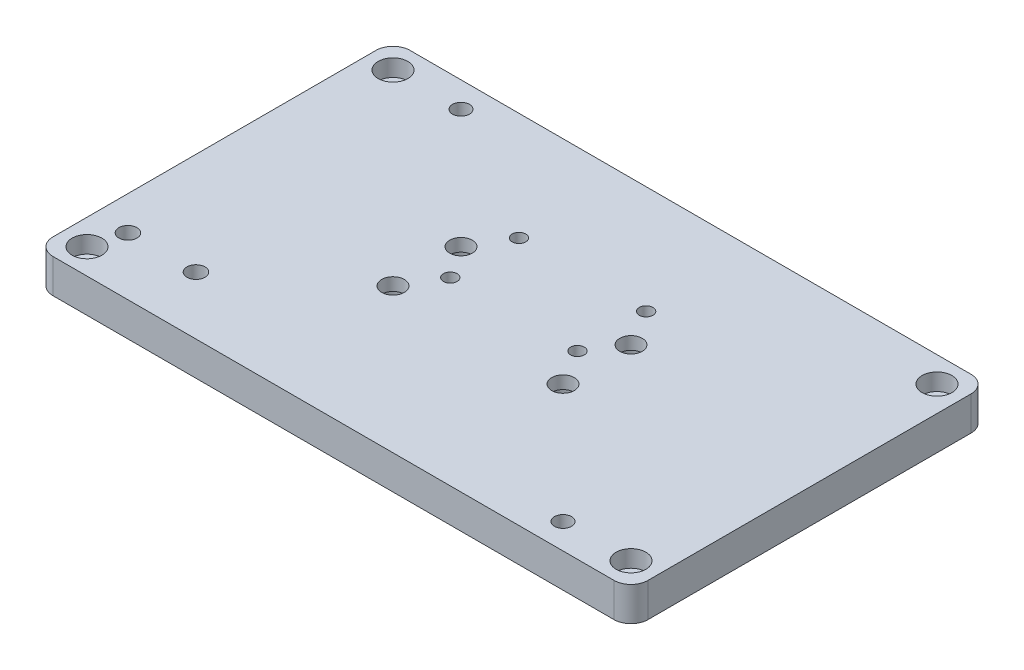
ISO-10303-21;
HEADER;
FILE_DESCRIPTION(('STEP AP214'),'2;1');
FILE_NAME('part.step','',(''),(''),'','','');
FILE_SCHEMA(('AUTOMOTIVE_DESIGN { 1 0 10303 214 1 1 1 1 }'));
ENDSEC;
DATA;
#1=APPLICATION_CONTEXT('core data for automotive mechanical design processes');
#2=APPLICATION_PROTOCOL_DEFINITION('international standard','automotive_design',2000,#1);
#3=PRODUCT_CONTEXT('',#1,'mechanical');
#4=PRODUCT('Part','Part','',(#3));
#5=PRODUCT_RELATED_PRODUCT_CATEGORY('part','',(#4));
#6=PRODUCT_DEFINITION_FORMATION('','',#4);
#7=PRODUCT_DEFINITION_CONTEXT('part definition',#1,'design');
#8=PRODUCT_DEFINITION('design','',#6,#7);
#9=PRODUCT_DEFINITION_SHAPE('','',#8);
#10=(LENGTH_UNIT() NAMED_UNIT(*) SI_UNIT(.MILLI.,.METRE.));
#11=(NAMED_UNIT(*) PLANE_ANGLE_UNIT() SI_UNIT($,.RADIAN.));
#12=(NAMED_UNIT(*) SI_UNIT($,.STERADIAN.) SOLID_ANGLE_UNIT());
#13=UNCERTAINTY_MEASURE_WITH_UNIT(LENGTH_MEASURE(1.E-05),#10,'distance_accuracy_value','');
#14=(GEOMETRIC_REPRESENTATION_CONTEXT(3) GLOBAL_UNCERTAINTY_ASSIGNED_CONTEXT((#13)) GLOBAL_UNIT_ASSIGNED_CONTEXT((#10,
#11,#12)) REPRESENTATION_CONTEXT('',''));
#15=CARTESIAN_POINT('',(0.,0.,0.));
#16=DIRECTION('',(0.,0.,1.));
#17=DIRECTION('',(1.,0.,0.));
#18=AXIS2_PLACEMENT_3D('',#15,#16,#17);
#19=CARTESIAN_POINT('',(111.125,12.7,-66.675));
#20=DIRECTION('',(-1.,0.,0.));
#21=DIRECTION('',(0.,0.,1.));
#22=AXIS2_PLACEMENT_3D('',#19,#20,#21);
#23=PLANE('',#22);
#24=DIRECTION('',(0.,0.,-1.));
#25=VECTOR('',#24,1.);
#26=CARTESIAN_POINT('',(111.125,0.,-66.675));
#27=LINE('',#26,#25);
#28=CARTESIAN_POINT('',(111.125,0.,60.325));
#29=VERTEX_POINT('',#28);
#30=CARTESIAN_POINT('',(111.125,0.,-60.325));
#31=VERTEX_POINT('',#30);
#32=EDGE_CURVE('E132',#29,#31,#27,.T.);
#33=ORIENTED_EDGE('',*,*,#32,.T.);
#34=DIRECTION('',(0.,-1.,0.));
#35=VECTOR('',#34,1.);
#36=CARTESIAN_POINT('',(111.125,12.7,-60.325));
#37=LINE('',#36,#35);
#38=CARTESIAN_POINT('',(111.125,12.7,-60.325));
#39=VERTEX_POINT('',#38);
#40=EDGE_CURVE('E109',#31,#39,#37,.F.);
#41=ORIENTED_EDGE('',*,*,#40,.T.);
#42=DIRECTION('',(0.,0.,-1.));
#43=VECTOR('',#42,1.);
#44=CARTESIAN_POINT('',(111.125,12.7,-66.675));
#45=LINE('',#44,#43);
#46=CARTESIAN_POINT('',(111.125,12.7,60.325));
#47=VERTEX_POINT('',#46);
#48=EDGE_CURVE('E142',#47,#39,#45,.T.);
#49=ORIENTED_EDGE('',*,*,#48,.F.);
#50=DIRECTION('',(0.,-1.,0.));
#51=VECTOR('',#50,1.);
#52=CARTESIAN_POINT('',(111.125,12.7,60.325));
#53=LINE('',#52,#51);
#54=EDGE_CURVE('E114',#47,#29,#53,.T.);
#55=ORIENTED_EDGE('',*,*,#54,.T.);
#56=EDGE_LOOP('',(#33,#41,#49,#55));
#57=FACE_BOUND('',#56,.T.);
#58=ADVANCED_FACE('F37',(#57),#23,.F.);
#59=CARTESIAN_POINT('',(-111.125,12.7,-66.675));
#60=DIRECTION('',(0.,0.,1.));
#61=DIRECTION('',(1.,0.,0.));
#62=AXIS2_PLACEMENT_3D('',#59,#60,#61);
#63=PLANE('',#62);
#64=DIRECTION('',(-1.,0.,0.));
#65=VECTOR('',#64,1.);
#66=CARTESIAN_POINT('',(-111.125,12.7,-66.675));
#67=LINE('',#66,#65);
#68=CARTESIAN_POINT('',(104.775,12.7,-66.675));
#69=VERTEX_POINT('',#68);
#70=CARTESIAN_POINT('',(-104.775,12.7,-66.675));
#71=VERTEX_POINT('',#70);
#72=EDGE_CURVE('E124',#69,#71,#67,.T.);
#73=ORIENTED_EDGE('',*,*,#72,.F.);
#74=DIRECTION('',(0.,-1.,0.));
#75=VECTOR('',#74,1.);
#76=CARTESIAN_POINT('',(104.775,12.7,-66.675));
#77=LINE('',#76,#75);
#78=CARTESIAN_POINT('',(104.775,0.,-66.675));
#79=VERTEX_POINT('',#78);
#80=EDGE_CURVE('E108',#69,#79,#77,.T.);
#81=ORIENTED_EDGE('',*,*,#80,.T.);
#82=DIRECTION('',(-1.,0.,0.));
#83=VECTOR('',#82,1.);
#84=CARTESIAN_POINT('',(-111.125,0.,-66.675));
#85=LINE('',#84,#83);
#86=CARTESIAN_POINT('',(-104.775,0.,-66.675));
#87=VERTEX_POINT('',#86);
#88=EDGE_CURVE('E121',#79,#87,#85,.T.);
#89=ORIENTED_EDGE('',*,*,#88,.T.);
#90=DIRECTION('',(0.,-1.,0.));
#91=VECTOR('',#90,1.);
#92=CARTESIAN_POINT('',(-104.775,12.7,-66.675));
#93=LINE('',#92,#91);
#94=EDGE_CURVE('E126',#87,#71,#93,.F.);
#95=ORIENTED_EDGE('',*,*,#94,.T.);
#96=EDGE_LOOP('',(#73,#81,#89,#95));
#97=FACE_BOUND('',#96,.T.);
#98=ADVANCED_FACE('F120',(#97),#63,.F.);
#99=CARTESIAN_POINT('',(-111.125,12.7,-66.675));
#100=DIRECTION('',(1.,0.,0.));
#101=DIRECTION('',(0.,0.,-1.));
#102=AXIS2_PLACEMENT_3D('',#99,#100,#101);
#103=PLANE('',#102);
#104=DIRECTION('',(0.,0.,1.));
#105=VECTOR('',#104,1.);
#106=CARTESIAN_POINT('',(-111.125,12.7,-66.675));
#107=LINE('',#106,#105);
#108=CARTESIAN_POINT('',(-111.125,12.7,-60.325));
#109=VERTEX_POINT('',#108);
#110=CARTESIAN_POINT('',(-111.125,12.7,60.325));
#111=VERTEX_POINT('',#110);
#112=EDGE_CURVE('E165',#109,#111,#107,.T.);
#113=ORIENTED_EDGE('',*,*,#112,.F.);
#114=DIRECTION('',(0.,-1.,0.));
#115=VECTOR('',#114,1.);
#116=CARTESIAN_POINT('',(-111.125,12.7,-60.325));
#117=LINE('',#116,#115);
#118=CARTESIAN_POINT('',(-111.125,0.,-60.325));
#119=VERTEX_POINT('',#118);
#120=EDGE_CURVE('E11',#109,#119,#117,.T.);
#121=ORIENTED_EDGE('',*,*,#120,.T.);
#122=DIRECTION('',(0.,0.,1.));
#123=VECTOR('',#122,1.);
#124=CARTESIAN_POINT('',(-111.125,0.,-66.675));
#125=LINE('',#124,#123);
#126=CARTESIAN_POINT('',(-111.125,0.,60.325));
#127=VERTEX_POINT('',#126);
#128=EDGE_CURVE('E131',#119,#127,#125,.T.);
#129=ORIENTED_EDGE('',*,*,#128,.T.);
#130=DIRECTION('',(0.,-1.,0.));
#131=VECTOR('',#130,1.);
#132=CARTESIAN_POINT('',(-111.125,12.7,60.325));
#133=LINE('',#132,#131);
#134=EDGE_CURVE('E45',#127,#111,#133,.F.);
#135=ORIENTED_EDGE('',*,*,#134,.T.);
#136=EDGE_LOOP('',(#113,#121,#129,#135));
#137=FACE_BOUND('',#136,.T.);
#138=ADVANCED_FACE('F164',(#137),#103,.F.);
#139=CARTESIAN_POINT('',(-111.125,12.7,66.675));
#140=DIRECTION('',(0.,0.,-1.));
#141=DIRECTION('',(-1.,0.,0.));
#142=AXIS2_PLACEMENT_3D('',#139,#140,#141);
#143=PLANE('',#142);
#144=DIRECTION('',(1.,0.,0.));
#145=VECTOR('',#144,1.);
#146=CARTESIAN_POINT('',(-111.125,0.,66.675));
#147=LINE('',#146,#145);
#148=CARTESIAN_POINT('',(-104.775,0.,66.675));
#149=VERTEX_POINT('',#148);
#150=CARTESIAN_POINT('',(104.775,0.,66.675));
#151=VERTEX_POINT('',#150);
#152=EDGE_CURVE('E135',#149,#151,#147,.T.);
#153=ORIENTED_EDGE('',*,*,#152,.T.);
#154=DIRECTION('',(0.,-1.,0.));
#155=VECTOR('',#154,1.);
#156=CARTESIAN_POINT('',(104.775,12.7,66.675));
#157=LINE('',#156,#155);
#158=CARTESIAN_POINT('',(104.775,12.7,66.675));
#159=VERTEX_POINT('',#158);
#160=EDGE_CURVE('E52',#151,#159,#157,.F.);
#161=ORIENTED_EDGE('',*,*,#160,.T.);
#162=DIRECTION('',(1.,0.,0.));
#163=VECTOR('',#162,1.);
#164=CARTESIAN_POINT('',(-111.125,12.7,66.675));
#165=LINE('',#164,#163);
#166=CARTESIAN_POINT('',(-104.775,12.7,66.675));
#167=VERTEX_POINT('',#166);
#168=EDGE_CURVE('E143',#167,#159,#165,.T.);
#169=ORIENTED_EDGE('',*,*,#168,.F.);
#170=DIRECTION('',(0.,-1.,0.));
#171=VECTOR('',#170,1.);
#172=CARTESIAN_POINT('',(-104.775,12.7,66.675));
#173=LINE('',#172,#171);
#174=EDGE_CURVE('E158',#167,#149,#173,.T.);
#175=ORIENTED_EDGE('',*,*,#174,.T.);
#176=EDGE_LOOP('',(#153,#161,#169,#175));
#177=FACE_BOUND('',#176,.T.);
#178=ADVANCED_FACE('F174',(#177),#143,.F.);
#179=CARTESIAN_POINT('',(0.,12.7,0.));
#180=DIRECTION('',(0.,1.,0.));
#181=DIRECTION('',(0.,0.,1.));
#182=AXIS2_PLACEMENT_3D('',#179,#180,#181);
#183=PLANE('',#182);
#184=CARTESIAN_POINT('',(-73.0250000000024,12.7,45.0249999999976));
#185=DIRECTION('',(0.,-1.,0.));
#186=DIRECTION('',(0.,0.,-1.));
#187=AXIS2_PLACEMENT_3D('',#184,#185,#186);
#188=CIRCLE('',#187,3.3782);
#189=CARTESIAN_POINT('',(-73.0250000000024,12.7,41.6467999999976));
#190=VERTEX_POINT('',#189);
#191=EDGE_CURVE('E351',#190,#190,#188,.T.);
#192=ORIENTED_EDGE('',*,*,#191,.T.);
#193=EDGE_LOOP('',(#192));
#194=FACE_BOUND('',#193,.T.);
#195=CARTESIAN_POINT('',(-98.4250000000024,12.7,45.0249999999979));
#196=DIRECTION('',(0.,-1.,0.));
#197=DIRECTION('',(0.,0.,-1.));
#198=AXIS2_PLACEMENT_3D('',#195,#196,#197);
#199=CIRCLE('',#198,3.3782);
#200=CARTESIAN_POINT('',(-98.4250000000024,12.7,41.6467999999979));
#201=VERTEX_POINT('',#200);
#202=EDGE_CURVE('E339',#201,#201,#199,.T.);
#203=ORIENTED_EDGE('',*,*,#202,.T.);
#204=EDGE_LOOP('',(#203));
#205=FACE_BOUND('',#204,.T.);
#206=CARTESIAN_POINT('',(23.7489999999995,12.7,-26.3477374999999));
#207=DIRECTION('',(0.,-1.,0.));
#208=DIRECTION('',(0.,0.,-1.));
#209=AXIS2_PLACEMENT_3D('',#206,#207,#208);
#210=CIRCLE('',#209,2.5527);
#211=CARTESIAN_POINT('',(23.7489999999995,12.7,-28.9004374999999));
#212=VERTEX_POINT('',#211);
#213=EDGE_CURVE('E327',#212,#212,#210,.T.);
#214=ORIENTED_EDGE('',*,*,#213,.T.);
#215=EDGE_LOOP('',(#214));
#216=FACE_BOUND('',#215,.T.);
#217=CARTESIAN_POINT('',(23.7489999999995,12.7,-0.693737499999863));
#218=DIRECTION('',(0.,-1.,0.));
#219=DIRECTION('',(0.,0.,-1.));
#220=AXIS2_PLACEMENT_3D('',#217,#218,#219);
#221=CIRCLE('',#220,2.5527);
#222=CARTESIAN_POINT('',(23.7489999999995,12.7,-3.24643749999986));
#223=VERTEX_POINT('',#222);
#224=EDGE_CURVE('E315',#223,#223,#221,.T.);
#225=ORIENTED_EDGE('',*,*,#224,.T.);
#226=EDGE_LOOP('',(#225));
#227=FACE_BOUND('',#226,.T.);
#228=CARTESIAN_POINT('',(-23.7490000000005,12.7,-26.3477374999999));
#229=DIRECTION('',(0.,-1.,0.));
#230=DIRECTION('',(0.,0.,-1.));
#231=AXIS2_PLACEMENT_3D('',#228,#229,#230);
#232=CIRCLE('',#231,2.5527);
#233=CARTESIAN_POINT('',(-23.7490000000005,12.7,-28.9004374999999));
#234=VERTEX_POINT('',#233);
#235=EDGE_CURVE('E303',#234,#234,#232,.T.);
#236=ORIENTED_EDGE('',*,*,#235,.T.);
#237=EDGE_LOOP('',(#236));
#238=FACE_BOUND('',#237,.T.);
#239=CARTESIAN_POINT('',(-23.7490000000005,12.7,-0.693737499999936));
#240=DIRECTION('',(0.,-1.,0.));
#241=DIRECTION('',(0.,0.,-1.));
#242=AXIS2_PLACEMENT_3D('',#239,#240,#241);
#243=CIRCLE('',#242,2.5527);
#244=CARTESIAN_POINT('',(-23.7490000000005,12.7,-3.24643749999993));
#245=VERTEX_POINT('',#244);
#246=EDGE_CURVE('E291',#245,#245,#243,.T.);
#247=ORIENTED_EDGE('',*,*,#246,.T.);
#248=EDGE_LOOP('',(#247));
#249=FACE_BOUND('',#248,.T.);
#250=CARTESIAN_POINT('',(76.2,12.7,57.15));
#251=DIRECTION('',(0.,1.,0.));
#252=DIRECTION('',(0.,0.,1.));
#253=AXIS2_PLACEMENT_3D('',#250,#251,#252);
#254=CIRCLE('',#253,3.175);
#255=CARTESIAN_POINT('',(76.2,12.7,60.325));
#256=VERTEX_POINT('',#255);
#257=EDGE_CURVE('E288',#256,#256,#254,.T.);
#258=ORIENTED_EDGE('',*,*,#257,.F.);
#259=EDGE_LOOP('',(#258));
#260=FACE_BOUND('',#259,.T.);
#261=CARTESIAN_POINT('',(-76.2,12.7,-57.1499999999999));
#262=DIRECTION('',(0.,1.,0.));
#263=DIRECTION('',(0.,0.,1.));
#264=AXIS2_PLACEMENT_3D('',#261,#262,#263);
#265=CIRCLE('',#264,3.175);
#266=CARTESIAN_POINT('',(-76.2,12.7,-53.9749999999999));
#267=VERTEX_POINT('',#266);
#268=EDGE_CURVE('E282',#267,#267,#265,.T.);
#269=ORIENTED_EDGE('',*,*,#268,.F.);
#270=EDGE_LOOP('',(#269));
#271=FACE_BOUND('',#270,.T.);
#272=CARTESIAN_POINT('',(101.6,12.7,57.15));
#273=DIRECTION('',(0.,1.,0.));
#274=DIRECTION('',(0.,0.,1.));
#275=AXIS2_PLACEMENT_3D('',#272,#273,#274);
#276=CIRCLE('',#275,5.55625);
#277=CARTESIAN_POINT('',(101.6,12.7,62.70625));
#278=VERTEX_POINT('',#277);
#279=EDGE_CURVE('E276',#278,#278,#276,.T.);
#280=ORIENTED_EDGE('',*,*,#279,.F.);
#281=EDGE_LOOP('',(#280));
#282=FACE_BOUND('',#281,.T.);
#283=CARTESIAN_POINT('',(101.6,12.7,-57.15));
#284=DIRECTION('',(0.,1.,0.));
#285=DIRECTION('',(0.,0.,1.));
#286=AXIS2_PLACEMENT_3D('',#283,#284,#285);
#287=CIRCLE('',#286,5.55625);
#288=CARTESIAN_POINT('',(101.6,12.7,-51.59375));
#289=VERTEX_POINT('',#288);
#290=EDGE_CURVE('E264',#289,#289,#287,.T.);
#291=ORIENTED_EDGE('',*,*,#290,.F.);
#292=EDGE_LOOP('',(#291));
#293=FACE_BOUND('',#292,.T.);
#294=CARTESIAN_POINT('',(-101.6,12.7,57.15));
#295=DIRECTION('',(0.,1.,0.));
#296=DIRECTION('',(0.,0.,1.));
#297=AXIS2_PLACEMENT_3D('',#294,#295,#296);
#298=CIRCLE('',#297,5.55625);
#299=CARTESIAN_POINT('',(-101.6,12.7,62.70625));
#300=VERTEX_POINT('',#299);
#301=EDGE_CURVE('E252',#300,#300,#298,.T.);
#302=ORIENTED_EDGE('',*,*,#301,.F.);
#303=EDGE_LOOP('',(#302));
#304=FACE_BOUND('',#303,.T.);
#305=CARTESIAN_POINT('',(-101.6,12.7,-57.1499999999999));
#306=DIRECTION('',(0.,1.,0.));
#307=DIRECTION('',(0.,0.,1.));
#308=AXIS2_PLACEMENT_3D('',#305,#306,#307);
#309=CIRCLE('',#308,5.55625);
#310=CARTESIAN_POINT('',(-101.6,12.7,-51.5937499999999));
#311=VERTEX_POINT('',#310);
#312=EDGE_CURVE('E240',#311,#311,#309,.T.);
#313=ORIENTED_EDGE('',*,*,#312,.F.);
#314=EDGE_LOOP('',(#313));
#315=FACE_BOUND('',#314,.T.);
#316=CARTESIAN_POINT('',(31.7500000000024,12.7,-12.6999999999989));
#317=DIRECTION('',(0.,-1.,0.));
#318=DIRECTION('',(0.,0.,-1.));
#319=AXIS2_PLACEMENT_3D('',#316,#317,#318);
#320=CIRCLE('',#319,4.21639999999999);
#321=CARTESIAN_POINT('',(31.7500000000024,12.7,-16.9163999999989));
#322=VERTEX_POINT('',#321);
#323=EDGE_CURVE('E219',#322,#322,#320,.T.);
#324=ORIENTED_EDGE('',*,*,#323,.T.);
#325=EDGE_LOOP('',(#324));
#326=FACE_BOUND('',#325,.T.);
#327=CARTESIAN_POINT('',(-31.7499999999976,12.7,-12.6999999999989));
#328=DIRECTION('',(0.,-1.,0.));
#329=DIRECTION('',(0.,0.,-1.));
#330=AXIS2_PLACEMENT_3D('',#327,#328,#329);
#331=CIRCLE('',#330,4.21639999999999);
#332=CARTESIAN_POINT('',(-31.7499999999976,12.7,-16.9163999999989));
#333=VERTEX_POINT('',#332);
#334=EDGE_CURVE('E207',#333,#333,#331,.T.);
#335=ORIENTED_EDGE('',*,*,#334,.T.);
#336=EDGE_LOOP('',(#335));
#337=FACE_BOUND('',#336,.T.);
#338=CARTESIAN_POINT('',(-31.7499999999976,12.7,12.7000000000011));
#339=DIRECTION('',(0.,-1.,0.));
#340=DIRECTION('',(0.,0.,-1.));
#341=AXIS2_PLACEMENT_3D('',#338,#339,#340);
#342=CIRCLE('',#341,4.21639999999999);
#343=CARTESIAN_POINT('',(-31.7499999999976,12.7,8.48360000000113));
#344=VERTEX_POINT('',#343);
#345=EDGE_CURVE('E195',#344,#344,#342,.T.);
#346=ORIENTED_EDGE('',*,*,#345,.T.);
#347=EDGE_LOOP('',(#346));
#348=FACE_BOUND('',#347,.T.);
#349=CARTESIAN_POINT('',(31.7500000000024,12.7,12.7000000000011));
#350=DIRECTION('',(0.,-1.,0.));
#351=DIRECTION('',(0.,0.,-1.));
#352=AXIS2_PLACEMENT_3D('',#349,#350,#351);
#353=CIRCLE('',#352,4.21639999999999);
#354=CARTESIAN_POINT('',(31.7500000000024,12.7,8.48360000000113));
#355=VERTEX_POINT('',#354);
#356=EDGE_CURVE('E137',#355,#355,#353,.T.);
#357=ORIENTED_EDGE('',*,*,#356,.T.);
#358=EDGE_LOOP('',(#357));
#359=FACE_BOUND('',#358,.T.);
#360=ORIENTED_EDGE('',*,*,#48,.T.);
#361=CARTESIAN_POINT('',(104.775,12.7,-60.325));
#362=DIRECTION('',(0.,1.,0.));
#363=DIRECTION('',(0.,0.,1.));
#364=AXIS2_PLACEMENT_3D('',#361,#362,#363);
#365=CIRCLE('',#364,6.35);
#366=EDGE_CURVE('E156',#39,#69,#365,.T.);
#367=ORIENTED_EDGE('',*,*,#366,.T.);
#368=ORIENTED_EDGE('',*,*,#72,.T.);
#369=CARTESIAN_POINT('',(-104.775,12.7,-60.325));
#370=DIRECTION('',(0.,1.,0.));
#371=DIRECTION('',(0.,0.,1.));
#372=AXIS2_PLACEMENT_3D('',#369,#370,#371);
#373=CIRCLE('',#372,6.35);
#374=EDGE_CURVE('E152',#71,#109,#373,.T.);
#375=ORIENTED_EDGE('',*,*,#374,.T.);
#376=ORIENTED_EDGE('',*,*,#112,.T.);
#377=CARTESIAN_POINT('',(-104.775,12.7,60.325));
#378=DIRECTION('',(0.,1.,0.));
#379=DIRECTION('',(0.,0.,1.));
#380=AXIS2_PLACEMENT_3D('',#377,#378,#379);
#381=CIRCLE('',#380,6.35);
#382=EDGE_CURVE('E59',#111,#167,#381,.T.);
#383=ORIENTED_EDGE('',*,*,#382,.T.);
#384=ORIENTED_EDGE('',*,*,#168,.T.);
#385=CARTESIAN_POINT('',(104.775,12.7,60.325));
#386=DIRECTION('',(0.,1.,0.));
#387=DIRECTION('',(0.,0.,1.));
#388=AXIS2_PLACEMENT_3D('',#385,#386,#387);
#389=CIRCLE('',#388,6.35);
#390=EDGE_CURVE('E154',#159,#47,#389,.T.);
#391=ORIENTED_EDGE('',*,*,#390,.T.);
#392=EDGE_LOOP('',(#360,#367,#368,#375,#376,#383,#384,#391));
#393=FACE_BOUND('',#392,.T.);
#394=ADVANCED_FACE('F169',(#194,#205,#216,#227,#238,#249,#260,#271,#282,#293,#304,#315,#326,
#337,#348,#359,#393),#183,.T.);
#395=CARTESIAN_POINT('',(0.,0.,0.));
#396=DIRECTION('',(0.,1.,0.));
#397=DIRECTION('',(0.,0.,1.));
#398=AXIS2_PLACEMENT_3D('',#395,#396,#397);
#399=PLANE('',#398);
#400=CARTESIAN_POINT('',(-73.0250000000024,0.,45.0249999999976));
#401=DIRECTION('',(0.,-1.,0.));
#402=DIRECTION('',(0.,0.,-1.));
#403=AXIS2_PLACEMENT_3D('',#400,#401,#402);
#404=CIRCLE('',#403,5.55625);
#405=CARTESIAN_POINT('',(-73.0250000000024,0.,39.4687499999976));
#406=VERTEX_POINT('',#405);
#407=EDGE_CURVE('E360',#406,#406,#404,.T.);
#408=ORIENTED_EDGE('',*,*,#407,.F.);
#409=EDGE_LOOP('',(#408));
#410=FACE_BOUND('',#409,.T.);
#411=CARTESIAN_POINT('',(-98.4250000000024,0.,45.0249999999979));
#412=DIRECTION('',(0.,-1.,0.));
#413=DIRECTION('',(0.,0.,-1.));
#414=AXIS2_PLACEMENT_3D('',#411,#412,#413);
#415=CIRCLE('',#414,5.55625);
#416=CARTESIAN_POINT('',(-98.4250000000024,0.,39.4687499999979));
#417=VERTEX_POINT('',#416);
#418=EDGE_CURVE('E348',#417,#417,#415,.T.);
#419=ORIENTED_EDGE('',*,*,#418,.F.);
#420=EDGE_LOOP('',(#419));
#421=FACE_BOUND('',#420,.T.);
#422=CARTESIAN_POINT('',(23.7489999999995,0.,-26.3477374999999));
#423=DIRECTION('',(0.,-1.,0.));
#424=DIRECTION('',(0.,0.,-1.));
#425=AXIS2_PLACEMENT_3D('',#422,#423,#424);
#426=CIRCLE('',#425,4.76249999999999);
#427=CARTESIAN_POINT('',(23.7489999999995,0.,-31.1102374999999));
#428=VERTEX_POINT('',#427);
#429=EDGE_CURVE('E336',#428,#428,#426,.T.);
#430=ORIENTED_EDGE('',*,*,#429,.F.);
#431=EDGE_LOOP('',(#430));
#432=FACE_BOUND('',#431,.T.);
#433=CARTESIAN_POINT('',(23.7489999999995,0.,-0.693737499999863));
#434=DIRECTION('',(0.,-1.,0.));
#435=DIRECTION('',(0.,0.,-1.));
#436=AXIS2_PLACEMENT_3D('',#433,#434,#435);
#437=CIRCLE('',#436,4.76249999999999);
#438=CARTESIAN_POINT('',(23.7489999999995,0.,-5.45623749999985));
#439=VERTEX_POINT('',#438);
#440=EDGE_CURVE('E324',#439,#439,#437,.T.);
#441=ORIENTED_EDGE('',*,*,#440,.F.);
#442=EDGE_LOOP('',(#441));
#443=FACE_BOUND('',#442,.T.);
#444=CARTESIAN_POINT('',(-23.7490000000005,0.,-26.3477374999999));
#445=DIRECTION('',(0.,-1.,0.));
#446=DIRECTION('',(0.,0.,-1.));
#447=AXIS2_PLACEMENT_3D('',#444,#445,#446);
#448=CIRCLE('',#447,4.76249999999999);
#449=CARTESIAN_POINT('',(-23.7490000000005,0.,-31.1102374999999));
#450=VERTEX_POINT('',#449);
#451=EDGE_CURVE('E312',#450,#450,#448,.T.);
#452=ORIENTED_EDGE('',*,*,#451,.F.);
#453=EDGE_LOOP('',(#452));
#454=FACE_BOUND('',#453,.T.);
#455=CARTESIAN_POINT('',(-23.7490000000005,0.,-0.693737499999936));
#456=DIRECTION('',(0.,-1.,0.));
#457=DIRECTION('',(0.,0.,-1.));
#458=AXIS2_PLACEMENT_3D('',#455,#456,#457);
#459=CIRCLE('',#458,4.76249999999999);
#460=CARTESIAN_POINT('',(-23.7490000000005,0.,-5.45623749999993));
#461=VERTEX_POINT('',#460);
#462=EDGE_CURVE('E300',#461,#461,#459,.T.);
#463=ORIENTED_EDGE('',*,*,#462,.F.);
#464=EDGE_LOOP('',(#463));
#465=FACE_BOUND('',#464,.T.);
#466=CARTESIAN_POINT('',(76.2,0.,57.15));
#467=DIRECTION('',(0.,1.,0.));
#468=DIRECTION('',(0.,0.,1.));
#469=AXIS2_PLACEMENT_3D('',#466,#467,#468);
#470=CIRCLE('',#469,3.175);
#471=CARTESIAN_POINT('',(76.2,0.,60.325));
#472=VERTEX_POINT('',#471);
#473=EDGE_CURVE('E285',#472,#472,#470,.T.);
#474=ORIENTED_EDGE('',*,*,#473,.T.);
#475=EDGE_LOOP('',(#474));
#476=FACE_BOUND('',#475,.T.);
#477=CARTESIAN_POINT('',(-76.2,0.,-57.1499999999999));
#478=DIRECTION('',(0.,1.,0.));
#479=DIRECTION('',(0.,0.,1.));
#480=AXIS2_PLACEMENT_3D('',#477,#478,#479);
#481=CIRCLE('',#480,3.175);
#482=CARTESIAN_POINT('',(-76.2,0.,-53.9749999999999));
#483=VERTEX_POINT('',#482);
#484=EDGE_CURVE('E279',#483,#483,#481,.T.);
#485=ORIENTED_EDGE('',*,*,#484,.T.);
#486=EDGE_LOOP('',(#485));
#487=FACE_BOUND('',#486,.T.);
#488=CARTESIAN_POINT('',(101.6,0.,57.15));
#489=DIRECTION('',(0.,1.,0.));
#490=DIRECTION('',(0.,0.,1.));
#491=AXIS2_PLACEMENT_3D('',#488,#489,#490);
#492=CIRCLE('',#491,3.3782);
#493=CARTESIAN_POINT('',(101.6,0.,60.5282));
#494=VERTEX_POINT('',#493);
#495=EDGE_CURVE('E267',#494,#494,#492,.T.);
#496=ORIENTED_EDGE('',*,*,#495,.T.);
#497=EDGE_LOOP('',(#496));
#498=FACE_BOUND('',#497,.T.);
#499=CARTESIAN_POINT('',(101.6,0.,-57.15));
#500=DIRECTION('',(0.,1.,0.));
#501=DIRECTION('',(0.,0.,1.));
#502=AXIS2_PLACEMENT_3D('',#499,#500,#501);
#503=CIRCLE('',#502,3.3782);
#504=CARTESIAN_POINT('',(101.6,0.,-53.7718));
#505=VERTEX_POINT('',#504);
#506=EDGE_CURVE('E255',#505,#505,#503,.T.);
#507=ORIENTED_EDGE('',*,*,#506,.T.);
#508=EDGE_LOOP('',(#507));
#509=FACE_BOUND('',#508,.T.);
#510=CARTESIAN_POINT('',(-101.6,0.,57.15));
#511=DIRECTION('',(0.,1.,0.));
#512=DIRECTION('',(0.,0.,1.));
#513=AXIS2_PLACEMENT_3D('',#510,#511,#512);
#514=CIRCLE('',#513,3.3782);
#515=CARTESIAN_POINT('',(-101.6,0.,60.5282));
#516=VERTEX_POINT('',#515);
#517=EDGE_CURVE('E243',#516,#516,#514,.T.);
#518=ORIENTED_EDGE('',*,*,#517,.T.);
#519=EDGE_LOOP('',(#518));
#520=FACE_BOUND('',#519,.T.);
#521=CARTESIAN_POINT('',(-101.6,0.,-57.1499999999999));
#522=DIRECTION('',(0.,1.,0.));
#523=DIRECTION('',(0.,0.,1.));
#524=AXIS2_PLACEMENT_3D('',#521,#522,#523);
#525=CIRCLE('',#524,3.3782);
#526=CARTESIAN_POINT('',(-101.6,0.,-53.7717999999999));
#527=VERTEX_POINT('',#526);
#528=EDGE_CURVE('E231',#527,#527,#525,.T.);
#529=ORIENTED_EDGE('',*,*,#528,.T.);
#530=EDGE_LOOP('',(#529));
#531=FACE_BOUND('',#530,.T.);
#532=CARTESIAN_POINT('',(31.7500000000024,0.,-12.6999999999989));
#533=DIRECTION('',(0.,-1.,0.));
#534=DIRECTION('',(0.,0.,-1.));
#535=AXIS2_PLACEMENT_3D('',#532,#533,#534);
#536=CIRCLE('',#535,6.74751);
#537=CARTESIAN_POINT('',(31.7500000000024,0.,-19.4475099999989));
#538=VERTEX_POINT('',#537);
#539=EDGE_CURVE('E228',#538,#538,#536,.T.);
#540=ORIENTED_EDGE('',*,*,#539,.F.);
#541=EDGE_LOOP('',(#540));
#542=FACE_BOUND('',#541,.T.);
#543=CARTESIAN_POINT('',(-31.7499999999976,0.,-12.6999999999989));
#544=DIRECTION('',(0.,-1.,0.));
#545=DIRECTION('',(0.,0.,-1.));
#546=AXIS2_PLACEMENT_3D('',#543,#544,#545);
#547=CIRCLE('',#546,6.74751);
#548=CARTESIAN_POINT('',(-31.7499999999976,0.,-19.4475099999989));
#549=VERTEX_POINT('',#548);
#550=EDGE_CURVE('E216',#549,#549,#547,.T.);
#551=ORIENTED_EDGE('',*,*,#550,.F.);
#552=EDGE_LOOP('',(#551));
#553=FACE_BOUND('',#552,.T.);
#554=CARTESIAN_POINT('',(-31.7499999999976,0.,12.7000000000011));
#555=DIRECTION('',(0.,-1.,0.));
#556=DIRECTION('',(0.,0.,-1.));
#557=AXIS2_PLACEMENT_3D('',#554,#555,#556);
#558=CIRCLE('',#557,6.74751);
#559=CARTESIAN_POINT('',(-31.7499999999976,0.,5.95249000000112));
#560=VERTEX_POINT('',#559);
#561=EDGE_CURVE('E204',#560,#560,#558,.T.);
#562=ORIENTED_EDGE('',*,*,#561,.F.);
#563=EDGE_LOOP('',(#562));
#564=FACE_BOUND('',#563,.T.);
#565=CARTESIAN_POINT('',(31.7500000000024,0.,12.7000000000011));
#566=DIRECTION('',(0.,-1.,0.));
#567=DIRECTION('',(0.,0.,-1.));
#568=AXIS2_PLACEMENT_3D('',#565,#566,#567);
#569=CIRCLE('',#568,6.74751);
#570=CARTESIAN_POINT('',(31.7500000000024,0.,5.95249000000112));
#571=VERTEX_POINT('',#570);
#572=EDGE_CURVE('E192',#571,#571,#569,.T.);
#573=ORIENTED_EDGE('',*,*,#572,.F.);
#574=EDGE_LOOP('',(#573));
#575=FACE_BOUND('',#574,.T.);
#576=ORIENTED_EDGE('',*,*,#88,.F.);
#577=CARTESIAN_POINT('',(104.775,0.,-60.325));
#578=DIRECTION('',(0.,1.,0.));
#579=DIRECTION('',(0.,0.,1.));
#580=AXIS2_PLACEMENT_3D('',#577,#578,#579);
#581=CIRCLE('',#580,6.35);
#582=EDGE_CURVE('E104',#79,#31,#581,.F.);
#583=ORIENTED_EDGE('',*,*,#582,.T.);
#584=ORIENTED_EDGE('',*,*,#32,.F.);
#585=CARTESIAN_POINT('',(104.775,0.,60.325));
#586=DIRECTION('',(0.,1.,0.));
#587=DIRECTION('',(0.,0.,1.));
#588=AXIS2_PLACEMENT_3D('',#585,#586,#587);
#589=CIRCLE('',#588,6.35);
#590=EDGE_CURVE('E115',#29,#151,#589,.F.);
#591=ORIENTED_EDGE('',*,*,#590,.T.);
#592=ORIENTED_EDGE('',*,*,#152,.F.);
#593=CARTESIAN_POINT('',(-104.775,0.,60.325));
#594=DIRECTION('',(0.,1.,0.));
#595=DIRECTION('',(0.,0.,1.));
#596=AXIS2_PLACEMENT_3D('',#593,#594,#595);
#597=CIRCLE('',#596,6.35);
#598=EDGE_CURVE('E125',#149,#127,#597,.F.);
#599=ORIENTED_EDGE('',*,*,#598,.T.);
#600=ORIENTED_EDGE('',*,*,#128,.F.);
#601=CARTESIAN_POINT('',(-104.775,0.,-60.325));
#602=DIRECTION('',(0.,1.,0.));
#603=DIRECTION('',(0.,0.,1.));
#604=AXIS2_PLACEMENT_3D('',#601,#602,#603);
#605=CIRCLE('',#604,6.35);
#606=EDGE_CURVE('E130',#119,#87,#605,.F.);
#607=ORIENTED_EDGE('',*,*,#606,.T.);
#608=EDGE_LOOP('',(#576,#583,#584,#591,#592,#599,#600,#607));
#609=FACE_BOUND('',#608,.T.);
#610=ADVANCED_FACE('F128',(#410,#421,#432,#443,#454,#465,#476,#487,#498,#509,#520,#531,#542,
#553,#564,#575,#609),#399,.F.);
#611=CARTESIAN_POINT('',(31.7500000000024,0.,12.7000000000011));
#612=DIRECTION('',(0.,-1.,0.));
#613=DIRECTION('',(0.,0.,-1.));
#614=AXIS2_PLACEMENT_3D('',#611,#612,#613);
#615=CYLINDRICAL_SURFACE('',#614,4.2164);
#616=ORIENTED_EDGE('',*,*,#356,.F.);
#617=EDGE_LOOP('',(#616));
#618=FACE_BOUND('',#617,.T.);
#619=CARTESIAN_POINT('',(31.7500000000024,7.9375,12.7000000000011));
#620=DIRECTION('',(0.,-1.,0.));
#621=DIRECTION('',(0.,0.,-1.));
#622=AXIS2_PLACEMENT_3D('',#619,#620,#621);
#623=CIRCLE('',#622,4.2164);
#624=CARTESIAN_POINT('',(31.7500000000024,7.9375,8.48360000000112));
#625=VERTEX_POINT('',#624);
#626=EDGE_CURVE('E186',#625,#625,#623,.T.);
#627=ORIENTED_EDGE('',*,*,#626,.T.);
#628=EDGE_LOOP('',(#627));
#629=FACE_BOUND('',#628,.T.);
#630=ADVANCED_FACE('F368',(#618,#629),#615,.F.);
#631=CARTESIAN_POINT('',(35.9664000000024,7.9375,12.7000000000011));
#632=DIRECTION('',(0.,1.,0.));
#633=DIRECTION('',(0.,0.,1.));
#634=AXIS2_PLACEMENT_3D('',#631,#632,#633);
#635=PLANE('',#634);
#636=ORIENTED_EDGE('',*,*,#626,.F.);
#637=EDGE_LOOP('',(#636));
#638=FACE_BOUND('',#637,.T.);
#639=CARTESIAN_POINT('',(31.7500000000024,7.9375,12.7000000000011));
#640=DIRECTION('',(0.,-1.,0.));
#641=DIRECTION('',(0.,0.,-1.));
#642=AXIS2_PLACEMENT_3D('',#639,#640,#641);
#643=CIRCLE('',#642,6.74751);
#644=CARTESIAN_POINT('',(31.7500000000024,7.9375,5.95249000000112));
#645=VERTEX_POINT('',#644);
#646=EDGE_CURVE('E189',#645,#645,#643,.T.);
#647=ORIENTED_EDGE('',*,*,#646,.T.);
#648=EDGE_LOOP('',(#647));
#649=FACE_BOUND('',#648,.T.);
#650=ADVANCED_FACE('F403',(#638,#649),#635,.F.);
#651=CARTESIAN_POINT('',(31.7500000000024,0.,12.7000000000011));
#652=DIRECTION('',(0.,-1.,0.));
#653=DIRECTION('',(0.,0.,-1.));
#654=AXIS2_PLACEMENT_3D('',#651,#652,#653);
#655=CYLINDRICAL_SURFACE('',#654,6.74751);
#656=ORIENTED_EDGE('',*,*,#646,.F.);
#657=EDGE_LOOP('',(#656));
#658=FACE_BOUND('',#657,.T.);
#659=ORIENTED_EDGE('',*,*,#572,.T.);
#660=EDGE_LOOP('',(#659));
#661=FACE_BOUND('',#660,.T.);
#662=ADVANCED_FACE('F400',(#658,#661),#655,.F.);
#663=CARTESIAN_POINT('',(-31.7499999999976,0.,12.7000000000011));
#664=DIRECTION('',(0.,-1.,0.));
#665=DIRECTION('',(0.,0.,-1.));
#666=AXIS2_PLACEMENT_3D('',#663,#664,#665);
#667=CYLINDRICAL_SURFACE('',#666,4.2164);
#668=ORIENTED_EDGE('',*,*,#345,.F.);
#669=EDGE_LOOP('',(#668));
#670=FACE_BOUND('',#669,.T.);
#671=CARTESIAN_POINT('',(-31.7499999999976,7.9375,12.7000000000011));
#672=DIRECTION('',(0.,-1.,0.));
#673=DIRECTION('',(0.,0.,-1.));
#674=AXIS2_PLACEMENT_3D('',#671,#672,#673);
#675=CIRCLE('',#674,4.2164);
#676=CARTESIAN_POINT('',(-31.7499999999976,7.9375,8.48360000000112));
#677=VERTEX_POINT('',#676);
#678=EDGE_CURVE('E198',#677,#677,#675,.T.);
#679=ORIENTED_EDGE('',*,*,#678,.T.);
#680=EDGE_LOOP('',(#679));
#681=FACE_BOUND('',#680,.T.);
#682=ADVANCED_FACE('F402',(#670,#681),#667,.F.);
#683=CARTESIAN_POINT('',(-27.5335999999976,7.9375,12.7000000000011));
#684=DIRECTION('',(0.,1.,0.));
#685=DIRECTION('',(0.,0.,1.));
#686=AXIS2_PLACEMENT_3D('',#683,#684,#685);
#687=PLANE('',#686);
#688=ORIENTED_EDGE('',*,*,#678,.F.);
#689=EDGE_LOOP('',(#688));
#690=FACE_BOUND('',#689,.T.);
#691=CARTESIAN_POINT('',(-31.7499999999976,7.9375,12.7000000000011));
#692=DIRECTION('',(0.,-1.,0.));
#693=DIRECTION('',(0.,0.,-1.));
#694=AXIS2_PLACEMENT_3D('',#691,#692,#693);
#695=CIRCLE('',#694,6.74751);
#696=CARTESIAN_POINT('',(-31.7499999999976,7.9375,5.95249000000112));
#697=VERTEX_POINT('',#696);
#698=EDGE_CURVE('E201',#697,#697,#695,.T.);
#699=ORIENTED_EDGE('',*,*,#698,.T.);
#700=EDGE_LOOP('',(#699));
#701=FACE_BOUND('',#700,.T.);
#702=ADVANCED_FACE('F410',(#690,#701),#687,.F.);
#703=CARTESIAN_POINT('',(-31.7499999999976,0.,12.7000000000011));
#704=DIRECTION('',(0.,-1.,0.));
#705=DIRECTION('',(0.,0.,-1.));
#706=AXIS2_PLACEMENT_3D('',#703,#704,#705);
#707=CYLINDRICAL_SURFACE('',#706,6.74751);
#708=ORIENTED_EDGE('',*,*,#698,.F.);
#709=EDGE_LOOP('',(#708));
#710=FACE_BOUND('',#709,.T.);
#711=ORIENTED_EDGE('',*,*,#561,.T.);
#712=EDGE_LOOP('',(#711));
#713=FACE_BOUND('',#712,.T.);
#714=ADVANCED_FACE('F875',(#710,#713),#707,.F.);
#715=CARTESIAN_POINT('',(-31.7499999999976,0.,-12.6999999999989));
#716=DIRECTION('',(0.,-1.,0.));
#717=DIRECTION('',(0.,0.,-1.));
#718=AXIS2_PLACEMENT_3D('',#715,#716,#717);
#719=CYLINDRICAL_SURFACE('',#718,4.2164);
#720=ORIENTED_EDGE('',*,*,#334,.F.);
#721=EDGE_LOOP('',(#720));
#722=FACE_BOUND('',#721,.T.);
#723=CARTESIAN_POINT('',(-31.7499999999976,7.9375,-12.6999999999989));
#724=DIRECTION('',(0.,-1.,0.));
#725=DIRECTION('',(0.,0.,-1.));
#726=AXIS2_PLACEMENT_3D('',#723,#724,#725);
#727=CIRCLE('',#726,4.2164);
#728=CARTESIAN_POINT('',(-31.7499999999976,7.9375,-16.9163999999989));
#729=VERTEX_POINT('',#728);
#730=EDGE_CURVE('E210',#729,#729,#727,.T.);
#731=ORIENTED_EDGE('',*,*,#730,.T.);
#732=EDGE_LOOP('',(#731));
#733=FACE_BOUND('',#732,.T.);
#734=ADVANCED_FACE('F865',(#722,#733),#719,.F.);
#735=CARTESIAN_POINT('',(-27.5335999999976,7.9375,-12.6999999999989));
#736=DIRECTION('',(0.,1.,0.));
#737=DIRECTION('',(0.,0.,1.));
#738=AXIS2_PLACEMENT_3D('',#735,#736,#737);
#739=PLANE('',#738);
#740=ORIENTED_EDGE('',*,*,#730,.F.);
#741=EDGE_LOOP('',(#740));
#742=FACE_BOUND('',#741,.T.);
#743=CARTESIAN_POINT('',(-31.7499999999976,7.9375,-12.6999999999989));
#744=DIRECTION('',(0.,-1.,0.));
#745=DIRECTION('',(0.,0.,-1.));
#746=AXIS2_PLACEMENT_3D('',#743,#744,#745);
#747=CIRCLE('',#746,6.74751);
#748=CARTESIAN_POINT('',(-31.7499999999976,7.9375,-19.4475099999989));
#749=VERTEX_POINT('',#748);
#750=EDGE_CURVE('E213',#749,#749,#747,.T.);
#751=ORIENTED_EDGE('',*,*,#750,.T.);
#752=EDGE_LOOP('',(#751));
#753=FACE_BOUND('',#752,.T.);
#754=ADVANCED_FACE('F854',(#742,#753),#739,.F.);
#755=CARTESIAN_POINT('',(-31.7499999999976,0.,-12.6999999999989));
#756=DIRECTION('',(0.,-1.,0.));
#757=DIRECTION('',(0.,0.,-1.));
#758=AXIS2_PLACEMENT_3D('',#755,#756,#757);
#759=CYLINDRICAL_SURFACE('',#758,6.74751);
#760=ORIENTED_EDGE('',*,*,#750,.F.);
#761=EDGE_LOOP('',(#760));
#762=FACE_BOUND('',#761,.T.);
#763=ORIENTED_EDGE('',*,*,#550,.T.);
#764=EDGE_LOOP('',(#763));
#765=FACE_BOUND('',#764,.T.);
#766=ADVANCED_FACE('F844',(#762,#765),#759,.F.);
#767=CARTESIAN_POINT('',(31.7500000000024,0.,-12.6999999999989));
#768=DIRECTION('',(0.,-1.,0.));
#769=DIRECTION('',(0.,0.,-1.));
#770=AXIS2_PLACEMENT_3D('',#767,#768,#769);
#771=CYLINDRICAL_SURFACE('',#770,4.2164);
#772=ORIENTED_EDGE('',*,*,#323,.F.);
#773=EDGE_LOOP('',(#772));
#774=FACE_BOUND('',#773,.T.);
#775=CARTESIAN_POINT('',(31.7500000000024,7.9375,-12.6999999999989));
#776=DIRECTION('',(0.,-1.,0.));
#777=DIRECTION('',(0.,0.,-1.));
#778=AXIS2_PLACEMENT_3D('',#775,#776,#777);
#779=CIRCLE('',#778,4.2164);
#780=CARTESIAN_POINT('',(31.7500000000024,7.9375,-16.9163999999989));
#781=VERTEX_POINT('',#780);
#782=EDGE_CURVE('E222',#781,#781,#779,.T.);
#783=ORIENTED_EDGE('',*,*,#782,.T.);
#784=EDGE_LOOP('',(#783));
#785=FACE_BOUND('',#784,.T.);
#786=ADVANCED_FACE('F834',(#774,#785),#771,.F.);
#787=CARTESIAN_POINT('',(35.9664000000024,7.9375,-12.6999999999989));
#788=DIRECTION('',(0.,1.,0.));
#789=DIRECTION('',(0.,0.,1.));
#790=AXIS2_PLACEMENT_3D('',#787,#788,#789);
#791=PLANE('',#790);
#792=ORIENTED_EDGE('',*,*,#782,.F.);
#793=EDGE_LOOP('',(#792));
#794=FACE_BOUND('',#793,.T.);
#795=CARTESIAN_POINT('',(31.7500000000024,7.9375,-12.6999999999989));
#796=DIRECTION('',(0.,-1.,0.));
#797=DIRECTION('',(0.,0.,-1.));
#798=AXIS2_PLACEMENT_3D('',#795,#796,#797);
#799=CIRCLE('',#798,6.74751);
#800=CARTESIAN_POINT('',(31.7500000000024,7.9375,-19.4475099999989));
#801=VERTEX_POINT('',#800);
#802=EDGE_CURVE('E225',#801,#801,#799,.T.);
#803=ORIENTED_EDGE('',*,*,#802,.T.);
#804=EDGE_LOOP('',(#803));
#805=FACE_BOUND('',#804,.T.);
#806=ADVANCED_FACE('F823',(#794,#805),#791,.F.);
#807=CARTESIAN_POINT('',(31.7500000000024,0.,-12.6999999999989));
#808=DIRECTION('',(0.,-1.,0.));
#809=DIRECTION('',(0.,0.,-1.));
#810=AXIS2_PLACEMENT_3D('',#807,#808,#809);
#811=CYLINDRICAL_SURFACE('',#810,6.74751);
#812=ORIENTED_EDGE('',*,*,#802,.F.);
#813=EDGE_LOOP('',(#812));
#814=FACE_BOUND('',#813,.T.);
#815=ORIENTED_EDGE('',*,*,#539,.T.);
#816=EDGE_LOOP('',(#815));
#817=FACE_BOUND('',#816,.T.);
#818=ADVANCED_FACE('F812',(#814,#817),#811,.F.);
#819=CARTESIAN_POINT('',(-101.6,12.7,-57.1499999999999));
#820=DIRECTION('',(0.,1.,0.));
#821=DIRECTION('',(0.,0.,1.));
#822=AXIS2_PLACEMENT_3D('',#819,#820,#821);
#823=CYLINDRICAL_SURFACE('',#822,3.3782);
#824=ORIENTED_EDGE('',*,*,#528,.F.);
#825=EDGE_LOOP('',(#824));
#826=FACE_BOUND('',#825,.T.);
#827=CARTESIAN_POINT('',(-101.6,6.35,-57.1499999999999));
#828=DIRECTION('',(0.,1.,0.));
#829=DIRECTION('',(0.,0.,1.));
#830=AXIS2_PLACEMENT_3D('',#827,#828,#829);
#831=CIRCLE('',#830,3.3782);
#832=CARTESIAN_POINT('',(-101.6,6.35,-53.7717999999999));
#833=VERTEX_POINT('',#832);
#834=EDGE_CURVE('E234',#833,#833,#831,.T.);
#835=ORIENTED_EDGE('',*,*,#834,.T.);
#836=EDGE_LOOP('',(#835));
#837=FACE_BOUND('',#836,.T.);
#838=ADVANCED_FACE('F802',(#826,#837),#823,.F.);
#839=CARTESIAN_POINT('',(-98.2218,6.35,-57.1499999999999));
#840=DIRECTION('',(0.,-1.,0.));
#841=DIRECTION('',(0.,0.,-1.));
#842=AXIS2_PLACEMENT_3D('',#839,#840,#841);
#843=PLANE('',#842);
#844=ORIENTED_EDGE('',*,*,#834,.F.);
#845=EDGE_LOOP('',(#844));
#846=FACE_BOUND('',#845,.T.);
#847=CARTESIAN_POINT('',(-101.6,6.35,-57.1499999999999));
#848=DIRECTION('',(0.,1.,0.));
#849=DIRECTION('',(0.,0.,1.));
#850=AXIS2_PLACEMENT_3D('',#847,#848,#849);
#851=CIRCLE('',#850,5.55625);
#852=CARTESIAN_POINT('',(-101.6,6.35,-51.5937499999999));
#853=VERTEX_POINT('',#852);
#854=EDGE_CURVE('E237',#853,#853,#851,.T.);
#855=ORIENTED_EDGE('',*,*,#854,.T.);
#856=EDGE_LOOP('',(#855));
#857=FACE_BOUND('',#856,.T.);
#858=ADVANCED_FACE('F792',(#846,#857),#843,.F.);
#859=CARTESIAN_POINT('',(-101.6,12.7,-57.1499999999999));
#860=DIRECTION('',(0.,1.,0.));
#861=DIRECTION('',(0.,0.,1.));
#862=AXIS2_PLACEMENT_3D('',#859,#860,#861);
#863=CYLINDRICAL_SURFACE('',#862,5.55625);
#864=ORIENTED_EDGE('',*,*,#854,.F.);
#865=EDGE_LOOP('',(#864));
#866=FACE_BOUND('',#865,.T.);
#867=ORIENTED_EDGE('',*,*,#312,.T.);
#868=EDGE_LOOP('',(#867));
#869=FACE_BOUND('',#868,.T.);
#870=ADVANCED_FACE('F782',(#866,#869),#863,.F.);
#871=CARTESIAN_POINT('',(-101.6,12.7,57.15));
#872=DIRECTION('',(0.,1.,0.));
#873=DIRECTION('',(0.,0.,1.));
#874=AXIS2_PLACEMENT_3D('',#871,#872,#873);
#875=CYLINDRICAL_SURFACE('',#874,3.3782);
#876=ORIENTED_EDGE('',*,*,#517,.F.);
#877=EDGE_LOOP('',(#876));
#878=FACE_BOUND('',#877,.T.);
#879=CARTESIAN_POINT('',(-101.6,6.35,57.15));
#880=DIRECTION('',(0.,1.,0.));
#881=DIRECTION('',(0.,0.,1.));
#882=AXIS2_PLACEMENT_3D('',#879,#880,#881);
#883=CIRCLE('',#882,3.3782);
#884=CARTESIAN_POINT('',(-101.6,6.35,60.5282));
#885=VERTEX_POINT('',#884);
#886=EDGE_CURVE('E246',#885,#885,#883,.T.);
#887=ORIENTED_EDGE('',*,*,#886,.T.);
#888=EDGE_LOOP('',(#887));
#889=FACE_BOUND('',#888,.T.);
#890=ADVANCED_FACE('F772',(#878,#889),#875,.F.);
#891=CARTESIAN_POINT('',(-98.2218,6.35,57.15));
#892=DIRECTION('',(0.,-1.,0.));
#893=DIRECTION('',(0.,0.,-1.));
#894=AXIS2_PLACEMENT_3D('',#891,#892,#893);
#895=PLANE('',#894);
#896=ORIENTED_EDGE('',*,*,#886,.F.);
#897=EDGE_LOOP('',(#896));
#898=FACE_BOUND('',#897,.T.);
#899=CARTESIAN_POINT('',(-101.6,6.35,57.15));
#900=DIRECTION('',(0.,1.,0.));
#901=DIRECTION('',(0.,0.,1.));
#902=AXIS2_PLACEMENT_3D('',#899,#900,#901);
#903=CIRCLE('',#902,5.55625);
#904=CARTESIAN_POINT('',(-101.6,6.35,62.70625));
#905=VERTEX_POINT('',#904);
#906=EDGE_CURVE('E249',#905,#905,#903,.T.);
#907=ORIENTED_EDGE('',*,*,#906,.T.);
#908=EDGE_LOOP('',(#907));
#909=FACE_BOUND('',#908,.T.);
#910=ADVANCED_FACE('F762',(#898,#909),#895,.F.);
#911=CARTESIAN_POINT('',(-101.6,12.7,57.15));
#912=DIRECTION('',(0.,1.,0.));
#913=DIRECTION('',(0.,0.,1.));
#914=AXIS2_PLACEMENT_3D('',#911,#912,#913);
#915=CYLINDRICAL_SURFACE('',#914,5.55625);
#916=ORIENTED_EDGE('',*,*,#906,.F.);
#917=EDGE_LOOP('',(#916));
#918=FACE_BOUND('',#917,.T.);
#919=ORIENTED_EDGE('',*,*,#301,.T.);
#920=EDGE_LOOP('',(#919));
#921=FACE_BOUND('',#920,.T.);
#922=ADVANCED_FACE('F752',(#918,#921),#915,.F.);
#923=CARTESIAN_POINT('',(101.6,12.7,-57.15));
#924=DIRECTION('',(0.,1.,0.));
#925=DIRECTION('',(0.,0.,1.));
#926=AXIS2_PLACEMENT_3D('',#923,#924,#925);
#927=CYLINDRICAL_SURFACE('',#926,3.3782);
#928=ORIENTED_EDGE('',*,*,#506,.F.);
#929=EDGE_LOOP('',(#928));
#930=FACE_BOUND('',#929,.T.);
#931=CARTESIAN_POINT('',(101.6,6.35,-57.15));
#932=DIRECTION('',(0.,1.,0.));
#933=DIRECTION('',(0.,0.,1.));
#934=AXIS2_PLACEMENT_3D('',#931,#932,#933);
#935=CIRCLE('',#934,3.3782);
#936=CARTESIAN_POINT('',(101.6,6.35,-53.7718));
#937=VERTEX_POINT('',#936);
#938=EDGE_CURVE('E258',#937,#937,#935,.T.);
#939=ORIENTED_EDGE('',*,*,#938,.T.);
#940=EDGE_LOOP('',(#939));
#941=FACE_BOUND('',#940,.T.);
#942=ADVANCED_FACE('F742',(#930,#941),#927,.F.);
#943=CARTESIAN_POINT('',(104.9782,6.35,-57.15));
#944=DIRECTION('',(0.,-1.,0.));
#945=DIRECTION('',(0.,0.,-1.));
#946=AXIS2_PLACEMENT_3D('',#943,#944,#945);
#947=PLANE('',#946);
#948=ORIENTED_EDGE('',*,*,#938,.F.);
#949=EDGE_LOOP('',(#948));
#950=FACE_BOUND('',#949,.T.);
#951=CARTESIAN_POINT('',(101.6,6.35,-57.15));
#952=DIRECTION('',(0.,1.,0.));
#953=DIRECTION('',(0.,0.,1.));
#954=AXIS2_PLACEMENT_3D('',#951,#952,#953);
#955=CIRCLE('',#954,5.55625);
#956=CARTESIAN_POINT('',(101.6,6.35,-51.59375));
#957=VERTEX_POINT('',#956);
#958=EDGE_CURVE('E261',#957,#957,#955,.T.);
#959=ORIENTED_EDGE('',*,*,#958,.T.);
#960=EDGE_LOOP('',(#959));
#961=FACE_BOUND('',#960,.T.);
#962=ADVANCED_FACE('F732',(#950,#961),#947,.F.);
#963=CARTESIAN_POINT('',(101.6,12.7,-57.15));
#964=DIRECTION('',(0.,1.,0.));
#965=DIRECTION('',(0.,0.,1.));
#966=AXIS2_PLACEMENT_3D('',#963,#964,#965);
#967=CYLINDRICAL_SURFACE('',#966,5.55625);
#968=ORIENTED_EDGE('',*,*,#958,.F.);
#969=EDGE_LOOP('',(#968));
#970=FACE_BOUND('',#969,.T.);
#971=ORIENTED_EDGE('',*,*,#290,.T.);
#972=EDGE_LOOP('',(#971));
#973=FACE_BOUND('',#972,.T.);
#974=ADVANCED_FACE('F722',(#970,#973),#967,.F.);
#975=CARTESIAN_POINT('',(101.6,12.7,57.15));
#976=DIRECTION('',(0.,1.,0.));
#977=DIRECTION('',(0.,0.,1.));
#978=AXIS2_PLACEMENT_3D('',#975,#976,#977);
#979=CYLINDRICAL_SURFACE('',#978,3.3782);
#980=ORIENTED_EDGE('',*,*,#495,.F.);
#981=EDGE_LOOP('',(#980));
#982=FACE_BOUND('',#981,.T.);
#983=CARTESIAN_POINT('',(101.6,6.35,57.15));
#984=DIRECTION('',(0.,1.,0.));
#985=DIRECTION('',(0.,0.,1.));
#986=AXIS2_PLACEMENT_3D('',#983,#984,#985);
#987=CIRCLE('',#986,3.3782);
#988=CARTESIAN_POINT('',(101.6,6.35,60.5282));
#989=VERTEX_POINT('',#988);
#990=EDGE_CURVE('E270',#989,#989,#987,.T.);
#991=ORIENTED_EDGE('',*,*,#990,.T.);
#992=EDGE_LOOP('',(#991));
#993=FACE_BOUND('',#992,.T.);
#994=ADVANCED_FACE('F712',(#982,#993),#979,.F.);
#995=CARTESIAN_POINT('',(104.9782,6.35,57.15));
#996=DIRECTION('',(0.,-1.,0.));
#997=DIRECTION('',(0.,0.,-1.));
#998=AXIS2_PLACEMENT_3D('',#995,#996,#997);
#999=PLANE('',#998);
#1000=ORIENTED_EDGE('',*,*,#990,.F.);
#1001=EDGE_LOOP('',(#1000));
#1002=FACE_BOUND('',#1001,.T.);
#1003=CARTESIAN_POINT('',(101.6,6.35,57.15));
#1004=DIRECTION('',(0.,1.,0.));
#1005=DIRECTION('',(0.,0.,1.));
#1006=AXIS2_PLACEMENT_3D('',#1003,#1004,#1005);
#1007=CIRCLE('',#1006,5.55625);
#1008=CARTESIAN_POINT('',(101.6,6.35,62.70625));
#1009=VERTEX_POINT('',#1008);
#1010=EDGE_CURVE('E273',#1009,#1009,#1007,.T.);
#1011=ORIENTED_EDGE('',*,*,#1010,.T.);
#1012=EDGE_LOOP('',(#1011));
#1013=FACE_BOUND('',#1012,.T.);
#1014=ADVANCED_FACE('F702',(#1002,#1013),#999,.F.);
#1015=CARTESIAN_POINT('',(101.6,12.7,57.15));
#1016=DIRECTION('',(0.,1.,0.));
#1017=DIRECTION('',(0.,0.,1.));
#1018=AXIS2_PLACEMENT_3D('',#1015,#1016,#1017);
#1019=CYLINDRICAL_SURFACE('',#1018,5.55625);
#1020=ORIENTED_EDGE('',*,*,#1010,.F.);
#1021=EDGE_LOOP('',(#1020));
#1022=FACE_BOUND('',#1021,.T.);
#1023=ORIENTED_EDGE('',*,*,#279,.T.);
#1024=EDGE_LOOP('',(#1023));
#1025=FACE_BOUND('',#1024,.T.);
#1026=ADVANCED_FACE('F692',(#1022,#1025),#1019,.F.);
#1027=CARTESIAN_POINT('',(-76.2,12.7,-57.1499999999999));
#1028=DIRECTION('',(0.,1.,0.));
#1029=DIRECTION('',(0.,0.,1.));
#1030=AXIS2_PLACEMENT_3D('',#1027,#1028,#1029);
#1031=CYLINDRICAL_SURFACE('',#1030,3.175);
#1032=ORIENTED_EDGE('',*,*,#484,.F.);
#1033=EDGE_LOOP('',(#1032));
#1034=FACE_BOUND('',#1033,.T.);
#1035=ORIENTED_EDGE('',*,*,#268,.T.);
#1036=EDGE_LOOP('',(#1035));
#1037=FACE_BOUND('',#1036,.T.);
#1038=ADVANCED_FACE('F682',(#1034,#1037),#1031,.F.);
#1039=CARTESIAN_POINT('',(76.2,12.7,57.15));
#1040=DIRECTION('',(0.,1.,0.));
#1041=DIRECTION('',(0.,0.,1.));
#1042=AXIS2_PLACEMENT_3D('',#1039,#1040,#1041);
#1043=CYLINDRICAL_SURFACE('',#1042,3.175);
#1044=ORIENTED_EDGE('',*,*,#473,.F.);
#1045=EDGE_LOOP('',(#1044));
#1046=FACE_BOUND('',#1045,.T.);
#1047=ORIENTED_EDGE('',*,*,#257,.T.);
#1048=EDGE_LOOP('',(#1047));
#1049=FACE_BOUND('',#1048,.T.);
#1050=ADVANCED_FACE('F672',(#1046,#1049),#1043,.F.);
#1051=CARTESIAN_POINT('',(-23.7490000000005,0.,-0.693737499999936));
#1052=DIRECTION('',(0.,-1.,0.));
#1053=DIRECTION('',(0.,0.,-1.));
#1054=AXIS2_PLACEMENT_3D('',#1051,#1052,#1053);
#1055=CYLINDRICAL_SURFACE('',#1054,2.55270000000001);
#1056=ORIENTED_EDGE('',*,*,#246,.F.);
#1057=EDGE_LOOP('',(#1056));
#1058=FACE_BOUND('',#1057,.T.);
#1059=CARTESIAN_POINT('',(-23.7490000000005,4.826,-0.693737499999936));
#1060=DIRECTION('',(0.,-1.,0.));
#1061=DIRECTION('',(0.,0.,-1.));
#1062=AXIS2_PLACEMENT_3D('',#1059,#1060,#1061);
#1063=CIRCLE('',#1062,2.55270000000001);
#1064=CARTESIAN_POINT('',(-23.7490000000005,4.826,-3.24643749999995));
#1065=VERTEX_POINT('',#1064);
#1066=EDGE_CURVE('E294',#1065,#1065,#1063,.T.);
#1067=ORIENTED_EDGE('',*,*,#1066,.T.);
#1068=EDGE_LOOP('',(#1067));
#1069=FACE_BOUND('',#1068,.T.);
#1070=ADVANCED_FACE('F662',(#1058,#1069),#1055,.F.);
#1071=CARTESIAN_POINT('',(-21.1963000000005,4.826,-0.693737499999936));
#1072=DIRECTION('',(0.,1.,0.));
#1073=DIRECTION('',(0.,0.,1.));
#1074=AXIS2_PLACEMENT_3D('',#1071,#1072,#1073);
#1075=PLANE('',#1074);
#1076=ORIENTED_EDGE('',*,*,#1066,.F.);
#1077=EDGE_LOOP('',(#1076));
#1078=FACE_BOUND('',#1077,.T.);
#1079=CARTESIAN_POINT('',(-23.7490000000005,4.826,-0.693737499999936));
#1080=DIRECTION('',(0.,-1.,0.));
#1081=DIRECTION('',(0.,0.,-1.));
#1082=AXIS2_PLACEMENT_3D('',#1079,#1080,#1081);
#1083=CIRCLE('',#1082,4.76249999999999);
#1084=CARTESIAN_POINT('',(-23.7490000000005,4.826,-5.45623749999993));
#1085=VERTEX_POINT('',#1084);
#1086=EDGE_CURVE('E297',#1085,#1085,#1083,.T.);
#1087=ORIENTED_EDGE('',*,*,#1086,.T.);
#1088=EDGE_LOOP('',(#1087));
#1089=FACE_BOUND('',#1088,.T.);
#1090=ADVANCED_FACE('F652',(#1078,#1089),#1075,.F.);
#1091=CARTESIAN_POINT('',(-23.7490000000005,0.,-0.693737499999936));
#1092=DIRECTION('',(0.,-1.,0.));
#1093=DIRECTION('',(0.,0.,-1.));
#1094=AXIS2_PLACEMENT_3D('',#1091,#1092,#1093);
#1095=CYLINDRICAL_SURFACE('',#1094,4.76249999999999);
#1096=ORIENTED_EDGE('',*,*,#1086,.F.);
#1097=EDGE_LOOP('',(#1096));
#1098=FACE_BOUND('',#1097,.T.);
#1099=ORIENTED_EDGE('',*,*,#462,.T.);
#1100=EDGE_LOOP('',(#1099));
#1101=FACE_BOUND('',#1100,.T.);
#1102=ADVANCED_FACE('F642',(#1098,#1101),#1095,.F.);
#1103=CARTESIAN_POINT('',(-23.7490000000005,0.,-26.3477374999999));
#1104=DIRECTION('',(0.,-1.,0.));
#1105=DIRECTION('',(0.,0.,-1.));
#1106=AXIS2_PLACEMENT_3D('',#1103,#1104,#1105);
#1107=CYLINDRICAL_SURFACE('',#1106,2.5527);
#1108=ORIENTED_EDGE('',*,*,#235,.F.);
#1109=EDGE_LOOP('',(#1108));
#1110=FACE_BOUND('',#1109,.T.);
#1111=CARTESIAN_POINT('',(-23.7490000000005,4.826,-26.3477374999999));
#1112=DIRECTION('',(0.,-1.,0.));
#1113=DIRECTION('',(0.,0.,-1.));
#1114=AXIS2_PLACEMENT_3D('',#1111,#1112,#1113);
#1115=CIRCLE('',#1114,2.55270000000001);
#1116=CARTESIAN_POINT('',(-23.7490000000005,4.826,-28.9004374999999));
#1117=VERTEX_POINT('',#1116);
#1118=EDGE_CURVE('E306',#1117,#1117,#1115,.T.);
#1119=ORIENTED_EDGE('',*,*,#1118,.T.);
#1120=EDGE_LOOP('',(#1119));
#1121=FACE_BOUND('',#1120,.T.);
#1122=ADVANCED_FACE('F632',(#1110,#1121),#1107,.F.);
#1123=CARTESIAN_POINT('',(-21.1963000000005,4.826,-26.3477374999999));
#1124=DIRECTION('',(0.,1.,0.));
#1125=DIRECTION('',(0.,0.,1.));
#1126=AXIS2_PLACEMENT_3D('',#1123,#1124,#1125);
#1127=PLANE('',#1126);
#1128=ORIENTED_EDGE('',*,*,#1118,.F.);
#1129=EDGE_LOOP('',(#1128));
#1130=FACE_BOUND('',#1129,.T.);
#1131=CARTESIAN_POINT('',(-23.7490000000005,4.826,-26.3477374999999));
#1132=DIRECTION('',(0.,-1.,0.));
#1133=DIRECTION('',(0.,0.,-1.));
#1134=AXIS2_PLACEMENT_3D('',#1131,#1132,#1133);
#1135=CIRCLE('',#1134,4.76249999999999);
#1136=CARTESIAN_POINT('',(-23.7490000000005,4.826,-31.1102374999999));
#1137=VERTEX_POINT('',#1136);
#1138=EDGE_CURVE('E309',#1137,#1137,#1135,.T.);
#1139=ORIENTED_EDGE('',*,*,#1138,.T.);
#1140=EDGE_LOOP('',(#1139));
#1141=FACE_BOUND('',#1140,.T.);
#1142=ADVANCED_FACE('F622',(#1130,#1141),#1127,.F.);
#1143=CARTESIAN_POINT('',(-23.7490000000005,0.,-26.3477374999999));
#1144=DIRECTION('',(0.,-1.,0.));
#1145=DIRECTION('',(0.,0.,-1.));
#1146=AXIS2_PLACEMENT_3D('',#1143,#1144,#1145);
#1147=CYLINDRICAL_SURFACE('',#1146,4.76249999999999);
#1148=ORIENTED_EDGE('',*,*,#1138,.F.);
#1149=EDGE_LOOP('',(#1148));
#1150=FACE_BOUND('',#1149,.T.);
#1151=ORIENTED_EDGE('',*,*,#451,.T.);
#1152=EDGE_LOOP('',(#1151));
#1153=FACE_BOUND('',#1152,.T.);
#1154=ADVANCED_FACE('F612',(#1150,#1153),#1147,.F.);
#1155=CARTESIAN_POINT('',(23.7489999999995,0.,-0.693737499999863));
#1156=DIRECTION('',(0.,-1.,0.));
#1157=DIRECTION('',(0.,0.,-1.));
#1158=AXIS2_PLACEMENT_3D('',#1155,#1156,#1157);
#1159=CYLINDRICAL_SURFACE('',#1158,2.55270000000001);
#1160=ORIENTED_EDGE('',*,*,#224,.F.);
#1161=EDGE_LOOP('',(#1160));
#1162=FACE_BOUND('',#1161,.T.);
#1163=CARTESIAN_POINT('',(23.7489999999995,4.826,-0.693737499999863));
#1164=DIRECTION('',(0.,-1.,0.));
#1165=DIRECTION('',(0.,0.,-1.));
#1166=AXIS2_PLACEMENT_3D('',#1163,#1164,#1165);
#1167=CIRCLE('',#1166,2.55270000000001);
#1168=CARTESIAN_POINT('',(23.7489999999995,4.826,-3.24643749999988));
#1169=VERTEX_POINT('',#1168);
#1170=EDGE_CURVE('E318',#1169,#1169,#1167,.T.);
#1171=ORIENTED_EDGE('',*,*,#1170,.T.);
#1172=EDGE_LOOP('',(#1171));
#1173=FACE_BOUND('',#1172,.T.);
#1174=ADVANCED_FACE('F602',(#1162,#1173),#1159,.F.);
#1175=CARTESIAN_POINT('',(26.3016999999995,4.826,-0.693737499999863));
#1176=DIRECTION('',(0.,1.,0.));
#1177=DIRECTION('',(0.,0.,1.));
#1178=AXIS2_PLACEMENT_3D('',#1175,#1176,#1177);
#1179=PLANE('',#1178);
#1180=ORIENTED_EDGE('',*,*,#1170,.F.);
#1181=EDGE_LOOP('',(#1180));
#1182=FACE_BOUND('',#1181,.T.);
#1183=CARTESIAN_POINT('',(23.7489999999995,4.826,-0.693737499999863));
#1184=DIRECTION('',(0.,-1.,0.));
#1185=DIRECTION('',(0.,0.,-1.));
#1186=AXIS2_PLACEMENT_3D('',#1183,#1184,#1185);
#1187=CIRCLE('',#1186,4.76249999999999);
#1188=CARTESIAN_POINT('',(23.7489999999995,4.826,-5.45623749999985));
#1189=VERTEX_POINT('',#1188);
#1190=EDGE_CURVE('E321',#1189,#1189,#1187,.T.);
#1191=ORIENTED_EDGE('',*,*,#1190,.T.);
#1192=EDGE_LOOP('',(#1191));
#1193=FACE_BOUND('',#1192,.T.);
#1194=ADVANCED_FACE('F592',(#1182,#1193),#1179,.F.);
#1195=CARTESIAN_POINT('',(23.7489999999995,0.,-0.693737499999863));
#1196=DIRECTION('',(0.,-1.,0.));
#1197=DIRECTION('',(0.,0.,-1.));
#1198=AXIS2_PLACEMENT_3D('',#1195,#1196,#1197);
#1199=CYLINDRICAL_SURFACE('',#1198,4.76249999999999);
#1200=ORIENTED_EDGE('',*,*,#1190,.F.);
#1201=EDGE_LOOP('',(#1200));
#1202=FACE_BOUND('',#1201,.T.);
#1203=ORIENTED_EDGE('',*,*,#440,.T.);
#1204=EDGE_LOOP('',(#1203));
#1205=FACE_BOUND('',#1204,.T.);
#1206=ADVANCED_FACE('F582',(#1202,#1205),#1199,.F.);
#1207=CARTESIAN_POINT('',(23.7489999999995,0.,-26.3477374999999));
#1208=DIRECTION('',(0.,-1.,0.));
#1209=DIRECTION('',(0.,0.,-1.));
#1210=AXIS2_PLACEMENT_3D('',#1207,#1208,#1209);
#1211=CYLINDRICAL_SURFACE('',#1210,2.5527);
#1212=ORIENTED_EDGE('',*,*,#213,.F.);
#1213=EDGE_LOOP('',(#1212));
#1214=FACE_BOUND('',#1213,.T.);
#1215=CARTESIAN_POINT('',(23.7489999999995,4.826,-26.3477374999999));
#1216=DIRECTION('',(0.,-1.,0.));
#1217=DIRECTION('',(0.,0.,-1.));
#1218=AXIS2_PLACEMENT_3D('',#1215,#1216,#1217);
#1219=CIRCLE('',#1218,2.55270000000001);
#1220=CARTESIAN_POINT('',(23.7489999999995,4.826,-28.9004374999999));
#1221=VERTEX_POINT('',#1220);
#1222=EDGE_CURVE('E330',#1221,#1221,#1219,.T.);
#1223=ORIENTED_EDGE('',*,*,#1222,.T.);
#1224=EDGE_LOOP('',(#1223));
#1225=FACE_BOUND('',#1224,.T.);
#1226=ADVANCED_FACE('F572',(#1214,#1225),#1211,.F.);
#1227=CARTESIAN_POINT('',(26.3016999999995,4.826,-26.3477374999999));
#1228=DIRECTION('',(0.,1.,0.));
#1229=DIRECTION('',(0.,0.,1.));
#1230=AXIS2_PLACEMENT_3D('',#1227,#1228,#1229);
#1231=PLANE('',#1230);
#1232=ORIENTED_EDGE('',*,*,#1222,.F.);
#1233=EDGE_LOOP('',(#1232));
#1234=FACE_BOUND('',#1233,.T.);
#1235=CARTESIAN_POINT('',(23.7489999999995,4.826,-26.3477374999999));
#1236=DIRECTION('',(0.,-1.,0.));
#1237=DIRECTION('',(0.,0.,-1.));
#1238=AXIS2_PLACEMENT_3D('',#1235,#1236,#1237);
#1239=CIRCLE('',#1238,4.76249999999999);
#1240=CARTESIAN_POINT('',(23.7489999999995,4.826,-31.1102374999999));
#1241=VERTEX_POINT('',#1240);
#1242=EDGE_CURVE('E333',#1241,#1241,#1239,.T.);
#1243=ORIENTED_EDGE('',*,*,#1242,.T.);
#1244=EDGE_LOOP('',(#1243));
#1245=FACE_BOUND('',#1244,.T.);
#1246=ADVANCED_FACE('F562',(#1234,#1245),#1231,.F.);
#1247=CARTESIAN_POINT('',(23.7489999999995,0.,-26.3477374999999));
#1248=DIRECTION('',(0.,-1.,0.));
#1249=DIRECTION('',(0.,0.,-1.));
#1250=AXIS2_PLACEMENT_3D('',#1247,#1248,#1249);
#1251=CYLINDRICAL_SURFACE('',#1250,4.76249999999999);
#1252=ORIENTED_EDGE('',*,*,#1242,.F.);
#1253=EDGE_LOOP('',(#1252));
#1254=FACE_BOUND('',#1253,.T.);
#1255=ORIENTED_EDGE('',*,*,#429,.T.);
#1256=EDGE_LOOP('',(#1255));
#1257=FACE_BOUND('',#1256,.T.);
#1258=ADVANCED_FACE('F552',(#1254,#1257),#1251,.F.);
#1259=CARTESIAN_POINT('',(-98.4250000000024,0.,45.0249999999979));
#1260=DIRECTION('',(0.,-1.,0.));
#1261=DIRECTION('',(0.,0.,-1.));
#1262=AXIS2_PLACEMENT_3D('',#1259,#1260,#1261);
#1263=CYLINDRICAL_SURFACE('',#1262,3.3782);
#1264=ORIENTED_EDGE('',*,*,#202,.F.);
#1265=EDGE_LOOP('',(#1264));
#1266=FACE_BOUND('',#1265,.T.);
#1267=CARTESIAN_POINT('',(-98.4250000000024,6.35,45.0249999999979));
#1268=DIRECTION('',(0.,-1.,0.));
#1269=DIRECTION('',(0.,0.,-1.));
#1270=AXIS2_PLACEMENT_3D('',#1267,#1268,#1269);
#1271=CIRCLE('',#1270,3.3782);
#1272=CARTESIAN_POINT('',(-98.4250000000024,6.35,41.6467999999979));
#1273=VERTEX_POINT('',#1272);
#1274=EDGE_CURVE('E342',#1273,#1273,#1271,.T.);
#1275=ORIENTED_EDGE('',*,*,#1274,.T.);
#1276=EDGE_LOOP('',(#1275));
#1277=FACE_BOUND('',#1276,.T.);
#1278=ADVANCED_FACE('F542',(#1266,#1277),#1263,.F.);
#1279=CARTESIAN_POINT('',(-95.0468000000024,6.35,45.0249999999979));
#1280=DIRECTION('',(0.,1.,0.));
#1281=DIRECTION('',(0.,0.,1.));
#1282=AXIS2_PLACEMENT_3D('',#1279,#1280,#1281);
#1283=PLANE('',#1282);
#1284=ORIENTED_EDGE('',*,*,#1274,.F.);
#1285=EDGE_LOOP('',(#1284));
#1286=FACE_BOUND('',#1285,.T.);
#1287=CARTESIAN_POINT('',(-98.4250000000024,6.35,45.0249999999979));
#1288=DIRECTION('',(0.,-1.,0.));
#1289=DIRECTION('',(0.,0.,-1.));
#1290=AXIS2_PLACEMENT_3D('',#1287,#1288,#1289);
#1291=CIRCLE('',#1290,5.55625);
#1292=CARTESIAN_POINT('',(-98.4250000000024,6.35,39.4687499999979));
#1293=VERTEX_POINT('',#1292);
#1294=EDGE_CURVE('E345',#1293,#1293,#1291,.T.);
#1295=ORIENTED_EDGE('',*,*,#1294,.T.);
#1296=EDGE_LOOP('',(#1295));
#1297=FACE_BOUND('',#1296,.T.);
#1298=ADVANCED_FACE('F532',(#1286,#1297),#1283,.F.);
#1299=CARTESIAN_POINT('',(-98.4250000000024,0.,45.0249999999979));
#1300=DIRECTION('',(0.,-1.,0.));
#1301=DIRECTION('',(0.,0.,-1.));
#1302=AXIS2_PLACEMENT_3D('',#1299,#1300,#1301);
#1303=CYLINDRICAL_SURFACE('',#1302,5.55625);
#1304=ORIENTED_EDGE('',*,*,#1294,.F.);
#1305=EDGE_LOOP('',(#1304));
#1306=FACE_BOUND('',#1305,.T.);
#1307=ORIENTED_EDGE('',*,*,#418,.T.);
#1308=EDGE_LOOP('',(#1307));
#1309=FACE_BOUND('',#1308,.T.);
#1310=ADVANCED_FACE('F522',(#1306,#1309),#1303,.F.);
#1311=CARTESIAN_POINT('',(-73.0250000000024,0.,45.0249999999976));
#1312=DIRECTION('',(0.,-1.,0.));
#1313=DIRECTION('',(0.,0.,-1.));
#1314=AXIS2_PLACEMENT_3D('',#1311,#1312,#1313);
#1315=CYLINDRICAL_SURFACE('',#1314,3.3782);
#1316=ORIENTED_EDGE('',*,*,#191,.F.);
#1317=EDGE_LOOP('',(#1316));
#1318=FACE_BOUND('',#1317,.T.);
#1319=CARTESIAN_POINT('',(-73.0250000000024,6.35,45.0249999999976));
#1320=DIRECTION('',(0.,-1.,0.));
#1321=DIRECTION('',(0.,0.,-1.));
#1322=AXIS2_PLACEMENT_3D('',#1319,#1320,#1321);
#1323=CIRCLE('',#1322,3.3782);
#1324=CARTESIAN_POINT('',(-73.0250000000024,6.35,41.6467999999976));
#1325=VERTEX_POINT('',#1324);
#1326=EDGE_CURVE('E354',#1325,#1325,#1323,.T.);
#1327=ORIENTED_EDGE('',*,*,#1326,.T.);
#1328=EDGE_LOOP('',(#1327));
#1329=FACE_BOUND('',#1328,.T.);
#1330=ADVANCED_FACE('F512',(#1318,#1329),#1315,.F.);
#1331=CARTESIAN_POINT('',(-69.6468000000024,6.35,45.0249999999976));
#1332=DIRECTION('',(0.,1.,0.));
#1333=DIRECTION('',(0.,0.,1.));
#1334=AXIS2_PLACEMENT_3D('',#1331,#1332,#1333);
#1335=PLANE('',#1334);
#1336=ORIENTED_EDGE('',*,*,#1326,.F.);
#1337=EDGE_LOOP('',(#1336));
#1338=FACE_BOUND('',#1337,.T.);
#1339=CARTESIAN_POINT('',(-73.0250000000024,6.35,45.0249999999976));
#1340=DIRECTION('',(0.,-1.,0.));
#1341=DIRECTION('',(0.,0.,-1.));
#1342=AXIS2_PLACEMENT_3D('',#1339,#1340,#1341);
#1343=CIRCLE('',#1342,5.55625);
#1344=CARTESIAN_POINT('',(-73.0250000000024,6.35,39.4687499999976));
#1345=VERTEX_POINT('',#1344);
#1346=EDGE_CURVE('E357',#1345,#1345,#1343,.T.);
#1347=ORIENTED_EDGE('',*,*,#1346,.T.);
#1348=EDGE_LOOP('',(#1347));
#1349=FACE_BOUND('',#1348,.T.);
#1350=ADVANCED_FACE('F502',(#1338,#1349),#1335,.F.);
#1351=CARTESIAN_POINT('',(-73.0250000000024,0.,45.0249999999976));
#1352=DIRECTION('',(0.,-1.,0.));
#1353=DIRECTION('',(0.,0.,-1.));
#1354=AXIS2_PLACEMENT_3D('',#1351,#1352,#1353);
#1355=CYLINDRICAL_SURFACE('',#1354,5.55625);
#1356=ORIENTED_EDGE('',*,*,#1346,.F.);
#1357=EDGE_LOOP('',(#1356));
#1358=FACE_BOUND('',#1357,.T.);
#1359=ORIENTED_EDGE('',*,*,#407,.T.);
#1360=EDGE_LOOP('',(#1359));
#1361=FACE_BOUND('',#1360,.T.);
#1362=ADVANCED_FACE('F364',(#1358,#1361),#1355,.F.);
#1363=CARTESIAN_POINT('',(104.775,12.7,-60.325));
#1364=DIRECTION('',(0.,-1.,0.));
#1365=DIRECTION('',(0.,0.,-1.));
#1366=AXIS2_PLACEMENT_3D('',#1363,#1364,#1365);
#1367=CYLINDRICAL_SURFACE('',#1366,6.35);
#1368=ORIENTED_EDGE('',*,*,#366,.F.);
#1369=ORIENTED_EDGE('',*,*,#40,.F.);
#1370=ORIENTED_EDGE('',*,*,#582,.F.);
#1371=ORIENTED_EDGE('',*,*,#80,.F.);
#1372=EDGE_LOOP('',(#1368,#1369,#1370,#1371));
#1373=FACE_BOUND('',#1372,.T.);
#1374=ADVANCED_FACE('F107',(#1373),#1367,.T.);
#1375=CARTESIAN_POINT('',(104.775,12.7,60.325));
#1376=DIRECTION('',(0.,-1.,0.));
#1377=DIRECTION('',(0.,0.,-1.));
#1378=AXIS2_PLACEMENT_3D('',#1375,#1376,#1377);
#1379=CYLINDRICAL_SURFACE('',#1378,6.35);
#1380=ORIENTED_EDGE('',*,*,#390,.F.);
#1381=ORIENTED_EDGE('',*,*,#160,.F.);
#1382=ORIENTED_EDGE('',*,*,#590,.F.);
#1383=ORIENTED_EDGE('',*,*,#54,.F.);
#1384=EDGE_LOOP('',(#1380,#1381,#1382,#1383));
#1385=FACE_BOUND('',#1384,.T.);
#1386=ADVANCED_FACE('F178',(#1385),#1379,.T.);
#1387=CARTESIAN_POINT('',(-104.775,12.7,-60.325));
#1388=DIRECTION('',(0.,-1.,0.));
#1389=DIRECTION('',(0.,0.,-1.));
#1390=AXIS2_PLACEMENT_3D('',#1387,#1388,#1389);
#1391=CYLINDRICAL_SURFACE('',#1390,6.35);
#1392=ORIENTED_EDGE('',*,*,#374,.F.);
#1393=ORIENTED_EDGE('',*,*,#94,.F.);
#1394=ORIENTED_EDGE('',*,*,#606,.F.);
#1395=ORIENTED_EDGE('',*,*,#120,.F.);
#1396=EDGE_LOOP('',(#1392,#1393,#1394,#1395));
#1397=FACE_BOUND('',#1396,.T.);
#1398=ADVANCED_FACE('F427',(#1397),#1391,.T.);
#1399=CARTESIAN_POINT('',(-104.775,12.7,60.325));
#1400=DIRECTION('',(0.,-1.,0.));
#1401=DIRECTION('',(0.,0.,-1.));
#1402=AXIS2_PLACEMENT_3D('',#1399,#1400,#1401);
#1403=CYLINDRICAL_SURFACE('',#1402,6.35);
#1404=ORIENTED_EDGE('',*,*,#382,.F.);
#1405=ORIENTED_EDGE('',*,*,#134,.F.);
#1406=ORIENTED_EDGE('',*,*,#598,.F.);
#1407=ORIENTED_EDGE('',*,*,#174,.F.);
#1408=EDGE_LOOP('',(#1404,#1405,#1406,#1407));
#1409=FACE_BOUND('',#1408,.T.);
#1410=ADVANCED_FACE('F39',(#1409),#1403,.T.);
#1411=CLOSED_SHELL('',(#58,#98,#138,#178,#394,#610,#630,#650,#662,#682,#702,#714,#734,#754,#766,
#786,#806,#818,#838,#858,#870,#890,#910,#922,#942,#962,#974,#994,#1014,#1026,#1038,#1050,#1070,
#1090,#1102,#1122,#1142,#1154,#1174,#1194,#1206,#1226,#1246,#1258,#1278,#1298,#1310,#1330,#1350,
#1362,#1374,#1386,#1398,#1410));
#1412=MANIFOLD_SOLID_BREP('B2',#1411);
#1413=ADVANCED_BREP_SHAPE_REPRESENTATION('',(#18,#1412),#14);
#1414=SHAPE_DEFINITION_REPRESENTATION(#9,#1413);
ENDSEC;
END-ISO-10303-21;
